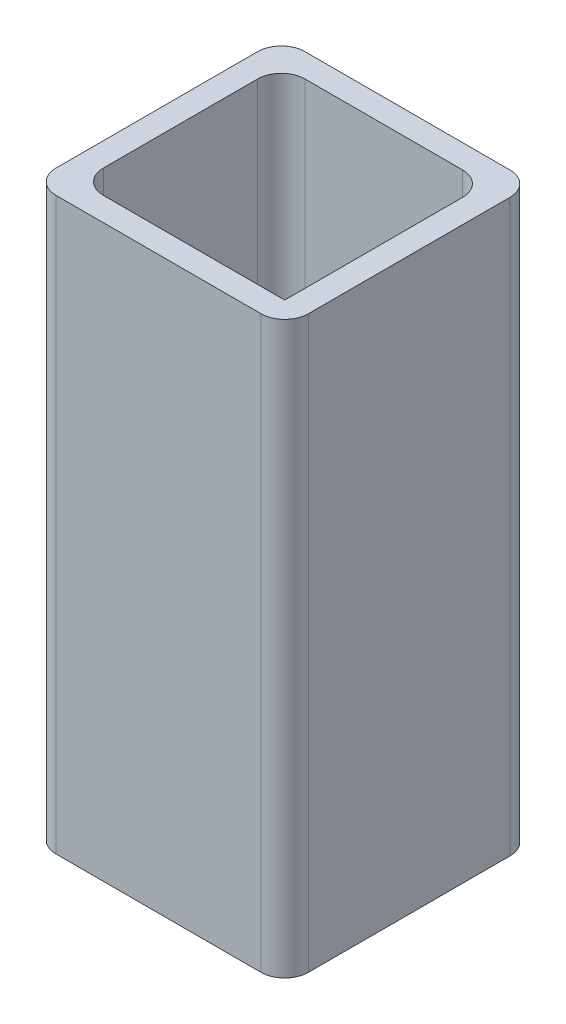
ISO-10303-21;
HEADER;
FILE_DESCRIPTION(('STEP AP214'),'2;1');
FILE_NAME('part.step','',(''),(''),'','','');
FILE_SCHEMA(('AUTOMOTIVE_DESIGN { 1 0 10303 214 1 1 1 1 }'));
ENDSEC;
DATA;
#1=APPLICATION_CONTEXT('core data for automotive mechanical design processes');
#2=APPLICATION_PROTOCOL_DEFINITION('international standard','automotive_design',2000,#1);
#3=PRODUCT_CONTEXT('',#1,'mechanical');
#4=PRODUCT('Part','Part','',(#3));
#5=PRODUCT_RELATED_PRODUCT_CATEGORY('part','',(#4));
#6=PRODUCT_DEFINITION_FORMATION('','',#4);
#7=PRODUCT_DEFINITION_CONTEXT('part definition',#1,'design');
#8=PRODUCT_DEFINITION('design','',#6,#7);
#9=PRODUCT_DEFINITION_SHAPE('','',#8);
#10=(LENGTH_UNIT() NAMED_UNIT(*) SI_UNIT(.MILLI.,.METRE.));
#11=(NAMED_UNIT(*) PLANE_ANGLE_UNIT() SI_UNIT($,.RADIAN.));
#12=(NAMED_UNIT(*) SI_UNIT($,.STERADIAN.) SOLID_ANGLE_UNIT());
#13=UNCERTAINTY_MEASURE_WITH_UNIT(LENGTH_MEASURE(1.E-05),#10,'distance_accuracy_value','');
#14=(GEOMETRIC_REPRESENTATION_CONTEXT(3) GLOBAL_UNCERTAINTY_ASSIGNED_CONTEXT((#13)) GLOBAL_UNIT_ASSIGNED_CONTEXT((#10,
#11,#12)) REPRESENTATION_CONTEXT('',''));
#15=CARTESIAN_POINT('',(0.,0.,0.));
#16=DIRECTION('',(0.,0.,1.));
#17=DIRECTION('',(1.,0.,0.));
#18=AXIS2_PLACEMENT_3D('',#15,#16,#17);
#19=CARTESIAN_POINT('',(-53.3084742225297,241.,52.5965540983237));
#20=DIRECTION('',(0.,1.,0.));
#21=DIRECTION('',(0.,0.,1.));
#22=AXIS2_PLACEMENT_3D('',#19,#20,#21);
#23=PLANE('',#22);
#24=DIRECTION('',(-1.,0.,0.));
#25=VECTOR('',#24,1.);
#26=CARTESIAN_POINT('',(-53.3084742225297,241.,-52.5965540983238));
#27=LINE('',#26,#25);
#28=CARTESIAN_POINT('',(43.3084742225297,241.,-52.5965540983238));
#29=VERTEX_POINT('',#28);
#30=CARTESIAN_POINT('',(-43.3084742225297,241.,-52.5965540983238));
#31=VERTEX_POINT('',#30);
#32=EDGE_CURVE('E181',#29,#31,#27,.T.);
#33=ORIENTED_EDGE('',*,*,#32,.T.);
#34=CARTESIAN_POINT('',(-43.3084742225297,241.,-42.5965540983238));
#35=DIRECTION('',(0.,1.,0.));
#36=DIRECTION('',(0.,0.,1.));
#37=AXIS2_PLACEMENT_3D('',#34,#35,#36);
#38=CIRCLE('',#37,10.);
#39=CARTESIAN_POINT('',(-53.3084742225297,241.,-42.5965540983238));
#40=VERTEX_POINT('',#39);
#41=EDGE_CURVE('E218',#31,#40,#38,.T.);
#42=ORIENTED_EDGE('',*,*,#41,.T.);
#43=DIRECTION('',(0.,0.,1.));
#44=VECTOR('',#43,1.);
#45=CARTESIAN_POINT('',(-53.3084742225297,241.,-52.5965540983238));
#46=LINE('',#45,#44);
#47=CARTESIAN_POINT('',(-53.3084742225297,241.,42.5965540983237));
#48=VERTEX_POINT('',#47);
#49=EDGE_CURVE('E171',#40,#48,#46,.T.);
#50=ORIENTED_EDGE('',*,*,#49,.T.);
#51=CARTESIAN_POINT('',(-43.3084742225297,241.,42.5965540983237));
#52=DIRECTION('',(0.,1.,0.));
#53=DIRECTION('',(0.,0.,1.));
#54=AXIS2_PLACEMENT_3D('',#51,#52,#53);
#55=CIRCLE('',#54,10.);
#56=CARTESIAN_POINT('',(-43.3084742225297,241.,52.5965540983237));
#57=VERTEX_POINT('',#56);
#58=EDGE_CURVE('E214',#48,#57,#55,.T.);
#59=ORIENTED_EDGE('',*,*,#58,.T.);
#60=DIRECTION('',(1.,0.,0.));
#61=VECTOR('',#60,1.);
#62=CARTESIAN_POINT('',(-53.3084742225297,241.,52.5965540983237));
#63=LINE('',#62,#61);
#64=CARTESIAN_POINT('',(43.3084742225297,241.,52.5965540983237));
#65=VERTEX_POINT('',#64);
#66=EDGE_CURVE('E174',#57,#65,#63,.T.);
#67=ORIENTED_EDGE('',*,*,#66,.T.);
#68=CARTESIAN_POINT('',(43.3084742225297,241.,42.5965540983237));
#69=DIRECTION('',(0.,1.,0.));
#70=DIRECTION('',(0.,0.,1.));
#71=AXIS2_PLACEMENT_3D('',#68,#69,#70);
#72=CIRCLE('',#71,10.);
#73=CARTESIAN_POINT('',(53.3084742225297,241.,42.5965540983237));
#74=VERTEX_POINT('',#73);
#75=EDGE_CURVE('E212',#65,#74,#72,.T.);
#76=ORIENTED_EDGE('',*,*,#75,.T.);
#77=DIRECTION('',(0.,0.,-1.));
#78=VECTOR('',#77,1.);
#79=CARTESIAN_POINT('',(53.3084742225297,241.,-52.5965540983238));
#80=LINE('',#79,#78);
#81=CARTESIAN_POINT('',(53.3084742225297,241.,-42.5965540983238));
#82=VERTEX_POINT('',#81);
#83=EDGE_CURVE('E178',#74,#82,#80,.T.);
#84=ORIENTED_EDGE('',*,*,#83,.T.);
#85=CARTESIAN_POINT('',(43.3084742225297,241.,-42.5965540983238));
#86=DIRECTION('',(0.,1.,0.));
#87=DIRECTION('',(0.,0.,1.));
#88=AXIS2_PLACEMENT_3D('',#85,#86,#87);
#89=CIRCLE('',#88,10.);
#90=EDGE_CURVE('E216',#82,#29,#89,.T.);
#91=ORIENTED_EDGE('',*,*,#90,.T.);
#92=EDGE_LOOP('',(#33,#42,#50,#59,#67,#76,#84,#91));
#93=FACE_BOUND('',#92,.T.);
#94=DIRECTION('',(1.,0.,0.));
#95=VECTOR('',#94,1.);
#96=CARTESIAN_POINT('',(-43.3084742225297,241.,42.5965540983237));
#97=LINE('',#96,#95);
#98=CARTESIAN_POINT('',(-33.3084742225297,241.,42.5965540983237));
#99=VERTEX_POINT('',#98);
#100=CARTESIAN_POINT('',(43.3084742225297,241.,42.5965540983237));
#101=VERTEX_POINT('',#100);
#102=EDGE_CURVE('E137',#99,#101,#97,.T.);
#103=ORIENTED_EDGE('',*,*,#102,.F.);
#104=CARTESIAN_POINT('',(-33.3084742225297,241.,32.5965540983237));
#105=DIRECTION('',(0.,1.,0.));
#106=DIRECTION('',(0.,0.,1.));
#107=AXIS2_PLACEMENT_3D('',#104,#105,#106);
#108=CIRCLE('',#107,10.);
#109=CARTESIAN_POINT('',(-43.3084742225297,241.,32.5965540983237));
#110=VERTEX_POINT('',#109);
#111=EDGE_CURVE('E248',#99,#110,#108,.F.);
#112=ORIENTED_EDGE('',*,*,#111,.T.);
#113=DIRECTION('',(0.,0.,1.));
#114=VECTOR('',#113,1.);
#115=CARTESIAN_POINT('',(-43.3084742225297,241.,-42.5965540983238));
#116=LINE('',#115,#114);
#117=CARTESIAN_POINT('',(-43.3084742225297,241.,-32.5965540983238));
#118=VERTEX_POINT('',#117);
#119=EDGE_CURVE('E147',#118,#110,#116,.T.);
#120=ORIENTED_EDGE('',*,*,#119,.F.);
#121=CARTESIAN_POINT('',(-33.3084742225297,241.,-32.5965540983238));
#122=DIRECTION('',(0.,1.,0.));
#123=DIRECTION('',(0.,0.,1.));
#124=AXIS2_PLACEMENT_3D('',#121,#122,#123);
#125=CIRCLE('',#124,10.);
#126=CARTESIAN_POINT('',(-33.3084742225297,241.,-42.5965540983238));
#127=VERTEX_POINT('',#126);
#128=EDGE_CURVE('E11',#118,#127,#125,.F.);
#129=ORIENTED_EDGE('',*,*,#128,.T.);
#130=DIRECTION('',(-1.,0.,0.));
#131=VECTOR('',#130,1.);
#132=CARTESIAN_POINT('',(-43.3084742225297,241.,-42.5965540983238));
#133=LINE('',#132,#131);
#134=CARTESIAN_POINT('',(33.3084742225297,241.,-42.5965540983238));
#135=VERTEX_POINT('',#134);
#136=EDGE_CURVE('E156',#135,#127,#133,.T.);
#137=ORIENTED_EDGE('',*,*,#136,.F.);
#138=CARTESIAN_POINT('',(33.3084742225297,241.,-32.5965540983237));
#139=DIRECTION('',(0.,1.,0.));
#140=DIRECTION('',(0.,0.,1.));
#141=AXIS2_PLACEMENT_3D('',#138,#139,#140);
#142=CIRCLE('',#141,10.);
#143=CARTESIAN_POINT('',(43.3084742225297,241.,-32.5965540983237));
#144=VERTEX_POINT('',#143);
#145=EDGE_CURVE('E45',#135,#144,#142,.F.);
#146=ORIENTED_EDGE('',*,*,#145,.T.);
#147=DIRECTION('',(0.,0.,-1.));
#148=VECTOR('',#147,1.);
#149=CARTESIAN_POINT('',(43.3084742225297,241.,-42.5965540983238));
#150=LINE('',#149,#148);
#151=EDGE_CURVE('E146',#101,#144,#150,.T.);
#152=ORIENTED_EDGE('',*,*,#151,.F.);
#153=EDGE_LOOP('',(#103,#112,#120,#129,#137,#146,#152));
#154=FACE_BOUND('',#153,.T.);
#155=ADVANCED_FACE('F30',(#93,#154),#23,.T.);
#156=CARTESIAN_POINT('',(-53.3084742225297,0.,52.5965540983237));
#157=DIRECTION('',(0.,1.,0.));
#158=DIRECTION('',(0.,0.,1.));
#159=AXIS2_PLACEMENT_3D('',#156,#157,#158);
#160=PLANE('',#159);
#161=DIRECTION('',(0.,0.,1.));
#162=VECTOR('',#161,1.);
#163=CARTESIAN_POINT('',(-53.3084742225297,0.,-52.5965540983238));
#164=LINE('',#163,#162);
#165=CARTESIAN_POINT('',(-53.3084742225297,0.,-42.5965540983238));
#166=VERTEX_POINT('',#165);
#167=CARTESIAN_POINT('',(-53.3084742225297,0.,42.5965540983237));
#168=VERTEX_POINT('',#167);
#169=EDGE_CURVE('E155',#166,#168,#164,.T.);
#170=ORIENTED_EDGE('',*,*,#169,.F.);
#171=CARTESIAN_POINT('',(-43.3084742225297,0.,-42.5965540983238));
#172=DIRECTION('',(0.,1.,0.));
#173=DIRECTION('',(0.,0.,1.));
#174=AXIS2_PLACEMENT_3D('',#171,#172,#173);
#175=CIRCLE('',#174,10.);
#176=CARTESIAN_POINT('',(-43.3084742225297,0.,-52.5965540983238));
#177=VERTEX_POINT('',#176);
#178=EDGE_CURVE('E205',#166,#177,#175,.F.);
#179=ORIENTED_EDGE('',*,*,#178,.T.);
#180=DIRECTION('',(-1.,0.,0.));
#181=VECTOR('',#180,1.);
#182=CARTESIAN_POINT('',(-53.3084742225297,0.,-52.5965540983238));
#183=LINE('',#182,#181);
#184=CARTESIAN_POINT('',(43.3084742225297,0.,-52.5965540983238));
#185=VERTEX_POINT('',#184);
#186=EDGE_CURVE('E175',#185,#177,#183,.T.);
#187=ORIENTED_EDGE('',*,*,#186,.F.);
#188=CARTESIAN_POINT('',(43.3084742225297,0.,-42.5965540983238));
#189=DIRECTION('',(0.,1.,0.));
#190=DIRECTION('',(0.,0.,1.));
#191=AXIS2_PLACEMENT_3D('',#188,#189,#190);
#192=CIRCLE('',#191,10.);
#193=CARTESIAN_POINT('',(53.3084742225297,0.,-42.5965540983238));
#194=VERTEX_POINT('',#193);
#195=EDGE_CURVE('E203',#185,#194,#192,.F.);
#196=ORIENTED_EDGE('',*,*,#195,.T.);
#197=DIRECTION('',(0.,0.,-1.));
#198=VECTOR('',#197,1.);
#199=CARTESIAN_POINT('',(53.3084742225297,0.,-52.5965540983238));
#200=LINE('',#199,#198);
#201=CARTESIAN_POINT('',(53.3084742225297,0.,42.5965540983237));
#202=VERTEX_POINT('',#201);
#203=EDGE_CURVE('E190',#202,#194,#200,.T.);
#204=ORIENTED_EDGE('',*,*,#203,.F.);
#205=CARTESIAN_POINT('',(43.3084742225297,0.,42.5965540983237));
#206=DIRECTION('',(0.,1.,0.));
#207=DIRECTION('',(0.,0.,1.));
#208=AXIS2_PLACEMENT_3D('',#205,#206,#207);
#209=CIRCLE('',#208,10.);
#210=CARTESIAN_POINT('',(43.3084742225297,0.,52.5965540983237));
#211=VERTEX_POINT('',#210);
#212=EDGE_CURVE('E199',#202,#211,#209,.F.);
#213=ORIENTED_EDGE('',*,*,#212,.T.);
#214=DIRECTION('',(1.,0.,0.));
#215=VECTOR('',#214,1.);
#216=CARTESIAN_POINT('',(-53.3084742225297,0.,52.5965540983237));
#217=LINE('',#216,#215);
#218=CARTESIAN_POINT('',(-43.3084742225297,0.,52.5965540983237));
#219=VERTEX_POINT('',#218);
#220=EDGE_CURVE('E187',#219,#211,#217,.T.);
#221=ORIENTED_EDGE('',*,*,#220,.F.);
#222=CARTESIAN_POINT('',(-43.3084742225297,0.,42.5965540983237));
#223=DIRECTION('',(0.,1.,0.));
#224=DIRECTION('',(0.,0.,1.));
#225=AXIS2_PLACEMENT_3D('',#222,#223,#224);
#226=CIRCLE('',#225,10.);
#227=EDGE_CURVE('E201',#219,#168,#226,.F.);
#228=ORIENTED_EDGE('',*,*,#227,.T.);
#229=EDGE_LOOP('',(#170,#179,#187,#196,#204,#213,#221,#228));
#230=FACE_BOUND('',#229,.T.);
#231=DIRECTION('',(-1.,0.,0.));
#232=VECTOR('',#231,1.);
#233=CARTESIAN_POINT('',(-43.3084742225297,0.,-42.5965540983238));
#234=LINE('',#233,#232);
#235=CARTESIAN_POINT('',(33.3084742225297,0.,-42.5965540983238));
#236=VERTEX_POINT('',#235);
#237=CARTESIAN_POINT('',(-33.3084742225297,0.,-42.5965540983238));
#238=VERTEX_POINT('',#237);
#239=EDGE_CURVE('E168',#236,#238,#234,.T.);
#240=ORIENTED_EDGE('',*,*,#239,.T.);
#241=CARTESIAN_POINT('',(-33.3084742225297,0.,-32.5965540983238));
#242=DIRECTION('',(0.,1.,0.));
#243=DIRECTION('',(0.,0.,1.));
#244=AXIS2_PLACEMENT_3D('',#241,#242,#243);
#245=CIRCLE('',#244,10.);
#246=CARTESIAN_POINT('',(-43.3084742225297,0.,-32.5965540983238));
#247=VERTEX_POINT('',#246);
#248=EDGE_CURVE('E38',#238,#247,#245,.T.);
#249=ORIENTED_EDGE('',*,*,#248,.T.);
#250=DIRECTION('',(0.,0.,1.));
#251=VECTOR('',#250,1.);
#252=CARTESIAN_POINT('',(-43.3084742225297,0.,-42.5965540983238));
#253=LINE('',#252,#251);
#254=CARTESIAN_POINT('',(-43.3084742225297,0.,32.5965540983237));
#255=VERTEX_POINT('',#254);
#256=EDGE_CURVE('E162',#247,#255,#253,.T.);
#257=ORIENTED_EDGE('',*,*,#256,.T.);
#258=CARTESIAN_POINT('',(-33.3084742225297,0.,32.5965540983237));
#259=DIRECTION('',(0.,1.,0.));
#260=DIRECTION('',(0.,0.,1.));
#261=AXIS2_PLACEMENT_3D('',#258,#259,#260);
#262=CIRCLE('',#261,10.);
#263=CARTESIAN_POINT('',(-33.3084742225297,0.,42.5965540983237));
#264=VERTEX_POINT('',#263);
#265=EDGE_CURVE('E246',#255,#264,#262,.T.);
#266=ORIENTED_EDGE('',*,*,#265,.T.);
#267=DIRECTION('',(1.,0.,0.));
#268=VECTOR('',#267,1.);
#269=CARTESIAN_POINT('',(-43.3084742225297,0.,42.5965540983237));
#270=LINE('',#269,#268);
#271=CARTESIAN_POINT('',(43.3084742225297,0.,42.5965540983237));
#272=VERTEX_POINT('',#271);
#273=EDGE_CURVE('E165',#264,#272,#270,.T.);
#274=ORIENTED_EDGE('',*,*,#273,.T.);
#275=DIRECTION('',(0.,0.,-1.));
#276=VECTOR('',#275,1.);
#277=CARTESIAN_POINT('',(43.3084742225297,0.,-42.5965540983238));
#278=LINE('',#277,#276);
#279=CARTESIAN_POINT('',(43.3084742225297,0.,-32.5965540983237));
#280=VERTEX_POINT('',#279);
#281=EDGE_CURVE('E154',#272,#280,#278,.T.);
#282=ORIENTED_EDGE('',*,*,#281,.T.);
#283=CARTESIAN_POINT('',(33.3084742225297,0.,-32.5965540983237));
#284=DIRECTION('',(0.,1.,0.));
#285=DIRECTION('',(0.,0.,1.));
#286=AXIS2_PLACEMENT_3D('',#283,#284,#285);
#287=CIRCLE('',#286,10.);
#288=EDGE_CURVE('E243',#280,#236,#287,.T.);
#289=ORIENTED_EDGE('',*,*,#288,.T.);
#290=EDGE_LOOP('',(#240,#249,#257,#266,#274,#282,#289));
#291=FACE_BOUND('',#290,.T.);
#292=ADVANCED_FACE('F251',(#230,#291),#160,.F.);
#293=CARTESIAN_POINT('',(-53.3084742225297,241.,-52.5965540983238));
#294=DIRECTION('',(1.,0.,0.));
#295=DIRECTION('',(0.,0.,-1.));
#296=AXIS2_PLACEMENT_3D('',#293,#294,#295);
#297=PLANE('',#296);
#298=ORIENTED_EDGE('',*,*,#49,.F.);
#299=DIRECTION('',(0.,-1.,0.));
#300=VECTOR('',#299,1.);
#301=CARTESIAN_POINT('',(-53.3084742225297,241.,-42.5965540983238));
#302=LINE('',#301,#300);
#303=EDGE_CURVE('E196',#40,#166,#302,.T.);
#304=ORIENTED_EDGE('',*,*,#303,.T.);
#305=ORIENTED_EDGE('',*,*,#169,.T.);
#306=DIRECTION('',(0.,-1.,0.));
#307=VECTOR('',#306,1.);
#308=CARTESIAN_POINT('',(-53.3084742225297,241.,42.5965540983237));
#309=LINE('',#308,#307);
#310=EDGE_CURVE('E184',#168,#48,#309,.F.);
#311=ORIENTED_EDGE('',*,*,#310,.T.);
#312=EDGE_LOOP('',(#298,#304,#305,#311));
#313=FACE_BOUND('',#312,.T.);
#314=ADVANCED_FACE('F285',(#313),#297,.F.);
#315=CARTESIAN_POINT('',(-53.3084742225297,241.,52.5965540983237));
#316=DIRECTION('',(0.,0.,-1.));
#317=DIRECTION('',(-1.,0.,0.));
#318=AXIS2_PLACEMENT_3D('',#315,#316,#317);
#319=PLANE('',#318);
#320=ORIENTED_EDGE('',*,*,#66,.F.);
#321=DIRECTION('',(0.,-1.,0.));
#322=VECTOR('',#321,1.);
#323=CARTESIAN_POINT('',(-43.3084742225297,241.,52.5965540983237));
#324=LINE('',#323,#322);
#325=EDGE_CURVE('E240',#57,#219,#324,.T.);
#326=ORIENTED_EDGE('',*,*,#325,.T.);
#327=ORIENTED_EDGE('',*,*,#220,.T.);
#328=DIRECTION('',(0.,-1.,0.));
#329=VECTOR('',#328,1.);
#330=CARTESIAN_POINT('',(43.3084742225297,241.,52.5965540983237));
#331=LINE('',#330,#329);
#332=EDGE_CURVE('E238',#211,#65,#331,.F.);
#333=ORIENTED_EDGE('',*,*,#332,.T.);
#334=EDGE_LOOP('',(#320,#326,#327,#333));
#335=FACE_BOUND('',#334,.T.);
#336=ADVANCED_FACE('F298',(#335),#319,.F.);
#337=CARTESIAN_POINT('',(53.3084742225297,241.,-52.5965540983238));
#338=DIRECTION('',(-1.,0.,0.));
#339=DIRECTION('',(0.,0.,1.));
#340=AXIS2_PLACEMENT_3D('',#337,#338,#339);
#341=PLANE('',#340);
#342=ORIENTED_EDGE('',*,*,#203,.T.);
#343=DIRECTION('',(0.,-1.,0.));
#344=VECTOR('',#343,1.);
#345=CARTESIAN_POINT('',(53.3084742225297,241.,-42.5965540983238));
#346=LINE('',#345,#344);
#347=EDGE_CURVE('E223',#194,#82,#346,.F.);
#348=ORIENTED_EDGE('',*,*,#347,.T.);
#349=ORIENTED_EDGE('',*,*,#83,.F.);
#350=DIRECTION('',(0.,-1.,0.));
#351=VECTOR('',#350,1.);
#352=CARTESIAN_POINT('',(53.3084742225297,241.,42.5965540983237));
#353=LINE('',#352,#351);
#354=EDGE_CURVE('E220',#74,#202,#353,.T.);
#355=ORIENTED_EDGE('',*,*,#354,.T.);
#356=EDGE_LOOP('',(#342,#348,#349,#355));
#357=FACE_BOUND('',#356,.T.);
#358=ADVANCED_FACE('F294',(#357),#341,.F.);
#359=CARTESIAN_POINT('',(-53.3084742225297,241.,-52.5965540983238));
#360=DIRECTION('',(0.,0.,1.));
#361=DIRECTION('',(1.,0.,0.));
#362=AXIS2_PLACEMENT_3D('',#359,#360,#361);
#363=PLANE('',#362);
#364=ORIENTED_EDGE('',*,*,#186,.T.);
#365=DIRECTION('',(0.,-1.,0.));
#366=VECTOR('',#365,1.);
#367=CARTESIAN_POINT('',(-43.3084742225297,241.,-52.5965540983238));
#368=LINE('',#367,#366);
#369=EDGE_CURVE('E210',#177,#31,#368,.F.);
#370=ORIENTED_EDGE('',*,*,#369,.T.);
#371=ORIENTED_EDGE('',*,*,#32,.F.);
#372=DIRECTION('',(0.,-1.,0.));
#373=VECTOR('',#372,1.);
#374=CARTESIAN_POINT('',(43.3084742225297,241.,-52.5965540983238));
#375=LINE('',#374,#373);
#376=EDGE_CURVE('E207',#29,#185,#375,.T.);
#377=ORIENTED_EDGE('',*,*,#376,.T.);
#378=EDGE_LOOP('',(#364,#370,#371,#377));
#379=FACE_BOUND('',#378,.T.);
#380=ADVANCED_FACE('F291',(#379),#363,.F.);
#381=CARTESIAN_POINT('',(-43.3084742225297,241.,-42.5965540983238));
#382=DIRECTION('',(1.,0.,0.));
#383=DIRECTION('',(0.,0.,-1.));
#384=AXIS2_PLACEMENT_3D('',#381,#382,#383);
#385=PLANE('',#384);
#386=ORIENTED_EDGE('',*,*,#119,.T.);
#387=DIRECTION('',(0.,-1.,0.));
#388=VECTOR('',#387,1.);
#389=CARTESIAN_POINT('',(-43.3084742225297,0.,32.5965540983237));
#390=LINE('',#389,#388);
#391=EDGE_CURVE('E234',#110,#255,#390,.T.);
#392=ORIENTED_EDGE('',*,*,#391,.T.);
#393=ORIENTED_EDGE('',*,*,#256,.F.);
#394=DIRECTION('',(0.,-1.,0.));
#395=VECTOR('',#394,1.);
#396=CARTESIAN_POINT('',(-43.3084742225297,241.,-32.5965540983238));
#397=LINE('',#396,#395);
#398=EDGE_CURVE('E232',#247,#118,#397,.F.);
#399=ORIENTED_EDGE('',*,*,#398,.T.);
#400=EDGE_LOOP('',(#386,#392,#393,#399));
#401=FACE_BOUND('',#400,.T.);
#402=ADVANCED_FACE('F258',(#401),#385,.T.);
#403=CARTESIAN_POINT('',(-43.3084742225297,241.,42.5965540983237));
#404=DIRECTION('',(0.,0.,-1.));
#405=DIRECTION('',(-1.,0.,0.));
#406=AXIS2_PLACEMENT_3D('',#403,#404,#405);
#407=PLANE('',#406);
#408=ORIENTED_EDGE('',*,*,#273,.F.);
#409=DIRECTION('',(0.,-1.,0.));
#410=VECTOR('',#409,1.);
#411=CARTESIAN_POINT('',(-33.3084742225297,241.,42.5965540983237));
#412=LINE('',#411,#410);
#413=EDGE_CURVE('E144',#264,#99,#412,.F.);
#414=ORIENTED_EDGE('',*,*,#413,.T.);
#415=ORIENTED_EDGE('',*,*,#102,.T.);
#416=DIRECTION('',(0.,-1.,0.));
#417=VECTOR('',#416,1.);
#418=CARTESIAN_POINT('',(43.3084742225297,241.,42.5965540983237));
#419=LINE('',#418,#417);
#420=EDGE_CURVE('E141',#101,#272,#419,.T.);
#421=ORIENTED_EDGE('',*,*,#420,.T.);
#422=EDGE_LOOP('',(#408,#414,#415,#421));
#423=FACE_BOUND('',#422,.T.);
#424=ADVANCED_FACE('F140',(#423),#407,.T.);
#425=CARTESIAN_POINT('',(43.3084742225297,241.,-42.5965540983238));
#426=DIRECTION('',(-1.,0.,0.));
#427=DIRECTION('',(0.,0.,1.));
#428=AXIS2_PLACEMENT_3D('',#425,#426,#427);
#429=PLANE('',#428);
#430=ORIENTED_EDGE('',*,*,#151,.T.);
#431=DIRECTION('',(0.,-1.,0.));
#432=VECTOR('',#431,1.);
#433=CARTESIAN_POINT('',(43.3084742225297,0.,-32.5965540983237));
#434=LINE('',#433,#432);
#435=EDGE_CURVE('E225',#144,#280,#434,.T.);
#436=ORIENTED_EDGE('',*,*,#435,.T.);
#437=ORIENTED_EDGE('',*,*,#281,.F.);
#438=ORIENTED_EDGE('',*,*,#420,.F.);
#439=EDGE_LOOP('',(#430,#436,#437,#438));
#440=FACE_BOUND('',#439,.T.);
#441=ADVANCED_FACE('F150',(#440),#429,.T.);
#442=CARTESIAN_POINT('',(-43.3084742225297,241.,-42.5965540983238));
#443=DIRECTION('',(0.,0.,1.));
#444=DIRECTION('',(1.,0.,0.));
#445=AXIS2_PLACEMENT_3D('',#442,#443,#444);
#446=PLANE('',#445);
#447=ORIENTED_EDGE('',*,*,#239,.F.);
#448=DIRECTION('',(0.,-1.,0.));
#449=VECTOR('',#448,1.);
#450=CARTESIAN_POINT('',(33.3084742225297,241.,-42.5965540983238));
#451=LINE('',#450,#449);
#452=EDGE_CURVE('E230',#236,#135,#451,.F.);
#453=ORIENTED_EDGE('',*,*,#452,.T.);
#454=ORIENTED_EDGE('',*,*,#136,.T.);
#455=DIRECTION('',(0.,-1.,0.));
#456=VECTOR('',#455,1.);
#457=CARTESIAN_POINT('',(-33.3084742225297,0.,-42.5965540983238));
#458=LINE('',#457,#456);
#459=EDGE_CURVE('E227',#127,#238,#458,.T.);
#460=ORIENTED_EDGE('',*,*,#459,.T.);
#461=EDGE_LOOP('',(#447,#453,#454,#460));
#462=FACE_BOUND('',#461,.T.);
#463=ADVANCED_FACE('F262',(#462),#446,.T.);
#464=CARTESIAN_POINT('',(-43.3084742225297,241.,-42.5965540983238));
#465=DIRECTION('',(0.,-1.,0.));
#466=DIRECTION('',(0.,0.,-1.));
#467=AXIS2_PLACEMENT_3D('',#464,#465,#466);
#468=CYLINDRICAL_SURFACE('',#467,10.);
#469=ORIENTED_EDGE('',*,*,#41,.F.);
#470=ORIENTED_EDGE('',*,*,#369,.F.);
#471=ORIENTED_EDGE('',*,*,#178,.F.);
#472=ORIENTED_EDGE('',*,*,#303,.F.);
#473=EDGE_LOOP('',(#469,#470,#471,#472));
#474=FACE_BOUND('',#473,.T.);
#475=ADVANCED_FACE('F306',(#474),#468,.T.);
#476=CARTESIAN_POINT('',(43.3084742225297,241.,-42.5965540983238));
#477=DIRECTION('',(0.,-1.,0.));
#478=DIRECTION('',(0.,0.,-1.));
#479=AXIS2_PLACEMENT_3D('',#476,#477,#478);
#480=CYLINDRICAL_SURFACE('',#479,10.);
#481=ORIENTED_EDGE('',*,*,#90,.F.);
#482=ORIENTED_EDGE('',*,*,#347,.F.);
#483=ORIENTED_EDGE('',*,*,#195,.F.);
#484=ORIENTED_EDGE('',*,*,#376,.F.);
#485=EDGE_LOOP('',(#481,#482,#483,#484));
#486=FACE_BOUND('',#485,.T.);
#487=ADVANCED_FACE('F277',(#486),#480,.T.);
#488=CARTESIAN_POINT('',(33.3084742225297,241.,-32.5965540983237));
#489=DIRECTION('',(0.,1.,0.));
#490=DIRECTION('',(0.,0.,1.));
#491=AXIS2_PLACEMENT_3D('',#488,#489,#490);
#492=CYLINDRICAL_SURFACE('',#491,10.);
#493=ORIENTED_EDGE('',*,*,#145,.F.);
#494=ORIENTED_EDGE('',*,*,#452,.F.);
#495=ORIENTED_EDGE('',*,*,#288,.F.);
#496=ORIENTED_EDGE('',*,*,#435,.F.);
#497=EDGE_LOOP('',(#493,#494,#495,#496));
#498=FACE_BOUND('',#497,.T.);
#499=ADVANCED_FACE('F265',(#498),#492,.F.);
#500=CARTESIAN_POINT('',(-33.3084742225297,241.,32.5965540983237));
#501=DIRECTION('',(0.,1.,0.));
#502=DIRECTION('',(0.,0.,1.));
#503=AXIS2_PLACEMENT_3D('',#500,#501,#502);
#504=CYLINDRICAL_SURFACE('',#503,10.);
#505=ORIENTED_EDGE('',*,*,#111,.F.);
#506=ORIENTED_EDGE('',*,*,#413,.F.);
#507=ORIENTED_EDGE('',*,*,#265,.F.);
#508=ORIENTED_EDGE('',*,*,#391,.F.);
#509=EDGE_LOOP('',(#505,#506,#507,#508));
#510=FACE_BOUND('',#509,.T.);
#511=ADVANCED_FACE('F267',(#510),#504,.F.);
#512=CARTESIAN_POINT('',(-43.3084742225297,241.,42.5965540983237));
#513=DIRECTION('',(0.,-1.,0.));
#514=DIRECTION('',(0.,0.,-1.));
#515=AXIS2_PLACEMENT_3D('',#512,#513,#514);
#516=CYLINDRICAL_SURFACE('',#515,10.);
#517=ORIENTED_EDGE('',*,*,#58,.F.);
#518=ORIENTED_EDGE('',*,*,#310,.F.);
#519=ORIENTED_EDGE('',*,*,#227,.F.);
#520=ORIENTED_EDGE('',*,*,#325,.F.);
#521=EDGE_LOOP('',(#517,#518,#519,#520));
#522=FACE_BOUND('',#521,.T.);
#523=ADVANCED_FACE('F269',(#522),#516,.T.);
#524=CARTESIAN_POINT('',(-33.3084742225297,241.,-32.5965540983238));
#525=DIRECTION('',(0.,1.,0.));
#526=DIRECTION('',(0.,0.,1.));
#527=AXIS2_PLACEMENT_3D('',#524,#525,#526);
#528=CYLINDRICAL_SURFACE('',#527,10.);
#529=ORIENTED_EDGE('',*,*,#128,.F.);
#530=ORIENTED_EDGE('',*,*,#398,.F.);
#531=ORIENTED_EDGE('',*,*,#248,.F.);
#532=ORIENTED_EDGE('',*,*,#459,.F.);
#533=EDGE_LOOP('',(#529,#530,#531,#532));
#534=FACE_BOUND('',#533,.T.);
#535=ADVANCED_FACE('F260',(#534),#528,.F.);
#536=CARTESIAN_POINT('',(43.3084742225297,241.,42.5965540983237));
#537=DIRECTION('',(0.,-1.,0.));
#538=DIRECTION('',(0.,0.,-1.));
#539=AXIS2_PLACEMENT_3D('',#536,#537,#538);
#540=CYLINDRICAL_SURFACE('',#539,10.);
#541=ORIENTED_EDGE('',*,*,#75,.F.);
#542=ORIENTED_EDGE('',*,*,#332,.F.);
#543=ORIENTED_EDGE('',*,*,#212,.F.);
#544=ORIENTED_EDGE('',*,*,#354,.F.);
#545=EDGE_LOOP('',(#541,#542,#543,#544));
#546=FACE_BOUND('',#545,.T.);
#547=ADVANCED_FACE('F32',(#546),#540,.T.);
#548=CLOSED_SHELL('',(#155,#292,#314,#336,#358,#380,#402,#424,#441,#463,#475,#487,#499,#511,
#523,#535,#547));
#549=MANIFOLD_SOLID_BREP('B2',#548);
#550=ADVANCED_BREP_SHAPE_REPRESENTATION('',(#18,#549),#14);
#551=SHAPE_DEFINITION_REPRESENTATION(#9,#550);
ENDSEC;
END-ISO-10303-21;
